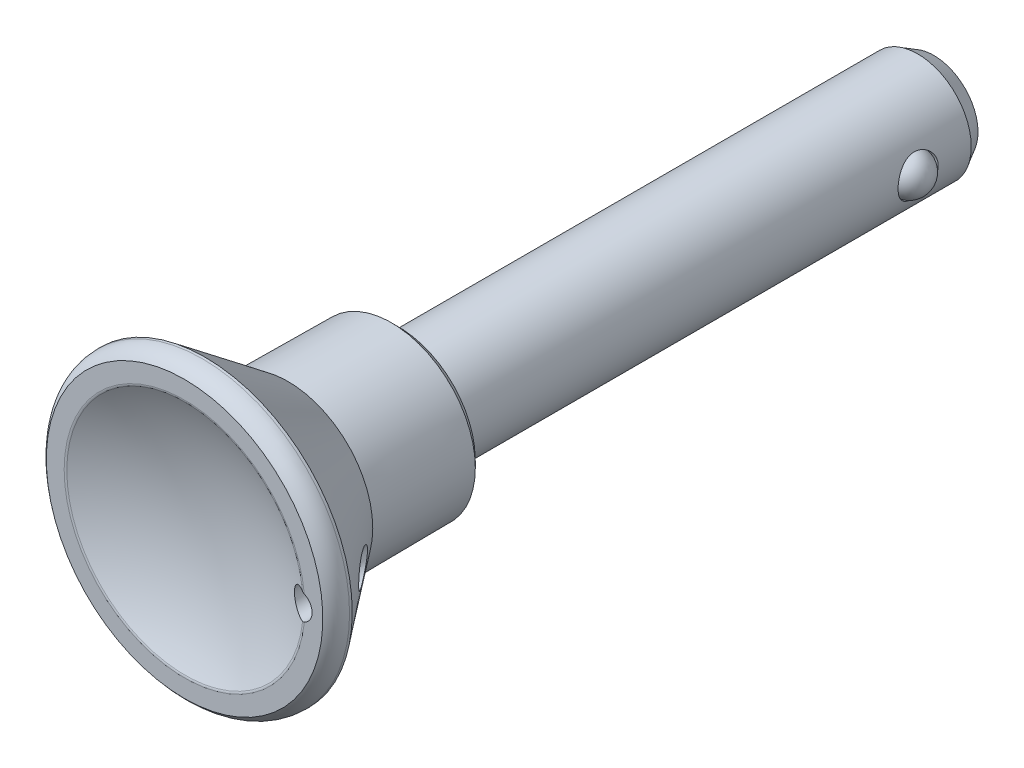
ISO-10303-21;
HEADER;
FILE_DESCRIPTION(('STEP AP214'),'2;1');
FILE_NAME('part.step','',(''),(''),'','','');
FILE_SCHEMA(('AUTOMOTIVE_DESIGN { 1 0 10303 214 1 1 1 1 }'));
ENDSEC;
DATA;
#1=APPLICATION_CONTEXT('core data for automotive mechanical design processes');
#2=APPLICATION_PROTOCOL_DEFINITION('international standard','automotive_design',2000,#1);
#3=PRODUCT_CONTEXT('',#1,'mechanical');
#4=PRODUCT('Part','Part','',(#3));
#5=PRODUCT_RELATED_PRODUCT_CATEGORY('part','',(#4));
#6=PRODUCT_DEFINITION_FORMATION('','',#4);
#7=PRODUCT_DEFINITION_CONTEXT('part definition',#1,'design');
#8=PRODUCT_DEFINITION('design','',#6,#7);
#9=PRODUCT_DEFINITION_SHAPE('','',#8);
#10=(LENGTH_UNIT() NAMED_UNIT(*) SI_UNIT(.MILLI.,.METRE.));
#11=(NAMED_UNIT(*) PLANE_ANGLE_UNIT() SI_UNIT($,.RADIAN.));
#12=(NAMED_UNIT(*) SI_UNIT($,.STERADIAN.) SOLID_ANGLE_UNIT());
#13=UNCERTAINTY_MEASURE_WITH_UNIT(LENGTH_MEASURE(1.E-05),#10,'distance_accuracy_value','');
#14=(GEOMETRIC_REPRESENTATION_CONTEXT(3) GLOBAL_UNCERTAINTY_ASSIGNED_CONTEXT((#13)) GLOBAL_UNIT_ASSIGNED_CONTEXT((#10,
#11,#12)) REPRESENTATION_CONTEXT('',''));
#15=CARTESIAN_POINT('',(0.,0.,0.));
#16=DIRECTION('',(0.,0.,1.));
#17=DIRECTION('',(1.,0.,0.));
#18=AXIS2_PLACEMENT_3D('',#15,#16,#17);
#19=CARTESIAN_POINT('',(0.,0.,23.5));
#20=DIRECTION('',(0.,0.,1.));
#21=DIRECTION('',(0.,-1.,0.));
#22=AXIS2_PLACEMENT_3D('',#19,#20,#21);
#23=TOROIDAL_SURFACE('',#22,13.499629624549,0.50000000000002);
#24=CARTESIAN_POINT('',(13.1832697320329,1.45020836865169,23.940350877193));
#25=CARTESIAN_POINT('',(13.1967898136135,1.44663630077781,23.9473693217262));
#26=CARTESIAN_POINT('',(13.2105528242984,1.44279517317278,23.9537540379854));
#27=CARTESIAN_POINT('',(13.2384329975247,1.43456873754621,23.9652617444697));
#28=CARTESIAN_POINT('',(13.2525500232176,1.43018363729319,23.9703852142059));
#29=CARTESIAN_POINT('',(13.294658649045,1.41639274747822,23.9836925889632));
#30=CARTESIAN_POINT('',(13.322980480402,1.40620303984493,23.9901034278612));
#31=CARTESIAN_POINT('',(13.3645007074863,1.38980064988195,23.9961744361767));
#32=CARTESIAN_POINT('',(13.377775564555,1.38433480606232,23.9976116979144));
#33=CARTESIAN_POINT('',(13.4043485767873,1.37294329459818,23.9995283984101));
#34=CARTESIAN_POINT('',(13.4176457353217,1.3670137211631,23.999998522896));
#35=CARTESIAN_POINT('',(13.430859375,1.3608881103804,24.));
#36=B_SPLINE_CURVE_WITH_KNOTS('',3,(#24,#25,#26,#27,#28,#29,#30,#31,#32,#33,#34,#35),
.UNSPECIFIED.,.F.,.F.,(4,2,2,2,2,4),(0.,0.046898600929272,0.0937793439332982,0.185591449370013,
0.228845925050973,0.272515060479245),.UNSPECIFIED.);
#37=CARTESIAN_POINT('',(13.1832697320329,1.45020836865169,23.940350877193));
#38=VERTEX_POINT('',#37);
#39=CARTESIAN_POINT('',(13.430859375,1.36088811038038,24.));
#40=VERTEX_POINT('',#39);
#41=EDGE_CURVE('E60',#38,#40,#36,.T.);
#42=ORIENTED_EDGE('',*,*,#41,.T.);
#43=CARTESIAN_POINT('',(0.,0.,24.));
#44=DIRECTION('',(0.,0.,1.));
#45=DIRECTION('',(0.,-1.,0.));
#46=AXIS2_PLACEMENT_3D('',#43,#44,#45);
#47=CIRCLE('',#46,13.499629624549);
#48=CARTESIAN_POINT('',(13.430859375,-1.36088811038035,24.));
#49=VERTEX_POINT('',#48);
#50=EDGE_CURVE('E39',#49,#40,#47,.F.);
#51=ORIENTED_EDGE('',*,*,#50,.F.);
#52=CARTESIAN_POINT('',(13.430859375,-1.36088811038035,24.));
#53=CARTESIAN_POINT('',(13.4166665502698,-1.36746807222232,23.9999984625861));
#54=CARTESIAN_POINT('',(13.4023759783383,-1.37382175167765,23.9994558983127));
#55=CARTESIAN_POINT('',(13.3736641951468,-1.38605678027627,23.9972288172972));
#56=CARTESIAN_POINT('',(13.3592428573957,-1.39193760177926,23.9955430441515));
#57=CARTESIAN_POINT('',(13.316571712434,-1.4085689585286,23.9887845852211));
#58=CARTESIAN_POINT('',(13.2882736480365,-1.41860415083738,23.9820148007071));
#59=CARTESIAN_POINT('',(13.2473798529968,-1.43179699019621,23.9685266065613));
#60=CARTESIAN_POINT('',(13.2344037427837,-1.43578270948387,23.9636790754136));
#61=CARTESIAN_POINT('',(13.2086362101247,-1.44332889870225,23.9528611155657));
#62=CARTESIAN_POINT('',(13.1958479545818,-1.44688469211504,23.9468798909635));
#63=CARTESIAN_POINT('',(13.1832697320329,-1.4502083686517,23.940350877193));
#64=B_SPLINE_CURVE_WITH_KNOTS('',3,(#52,#53,#54,#55,#56,#57,#58,#59,#60,#61,#62,#63),
.UNSPECIFIED.,.F.,.F.,(4,2,2,2,2,4),(0.,0.0469051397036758,0.0938619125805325,0.185680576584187,
0.228880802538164,0.272515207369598),.UNSPECIFIED.);
#65=CARTESIAN_POINT('',(13.1832697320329,-1.4502083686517,23.940350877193));
#66=VERTEX_POINT('',#65);
#67=EDGE_CURVE('E20',#49,#66,#64,.T.);
#68=ORIENTED_EDGE('',*,*,#67,.T.);
#69=CARTESIAN_POINT('',(0.,0.,23.940350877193));
#70=DIRECTION('',(0.,0.,1.));
#71=DIRECTION('',(0.,-1.,0.));
#72=AXIS2_PLACEMENT_3D('',#69,#70,#71);
#73=CIRCLE('',#72,13.2627940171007);
#74=EDGE_CURVE('E54',#38,#66,#73,.T.);
#75=ORIENTED_EDGE('',*,*,#74,.F.);
#76=EDGE_LOOP('',(#42,#51,#68,#75));
#77=FACE_BOUND('',#76,.T.);
#78=ADVANCED_FACE('F15',(#77),#23,.T.);
#79=CARTESIAN_POINT('',(0.,0.,48.6));
#80=DIRECTION('',(0.,-1.,0.));
#81=DIRECTION('',(0.,0.,1.));
#82=AXIS2_PLACEMENT_3D('',#79,#80,#81);
#83=SPHERICAL_SURFACE('',#82,28.);
#84=CARTESIAN_POINT('',(13.1832697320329,1.45020836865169,23.940350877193));
#85=CARTESIAN_POINT('',(13.0915993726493,1.4744532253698,23.8927620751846));
#86=CARTESIAN_POINT('',(12.9980560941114,1.489860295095,23.8443501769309));
#87=CARTESIAN_POINT('',(12.8097591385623,1.50293318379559,23.7471842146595));
#88=CARTESIAN_POINT('',(12.7150040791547,1.50057651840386,23.6984297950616));
#89=CARTESIAN_POINT('',(12.5270201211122,1.47798913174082,23.6019874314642));
#90=CARTESIAN_POINT('',(12.4337919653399,1.45774995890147,23.5543000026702));
#91=CARTESIAN_POINT('',(12.2517517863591,1.39948117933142,23.4614379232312));
#92=CARTESIAN_POINT('',(12.1629377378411,1.36145981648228,23.416262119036));
#93=CARTESIAN_POINT('',(11.9952411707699,1.26934990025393,23.3311736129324));
#94=CARTESIAN_POINT('',(11.9161458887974,1.21575714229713,23.2911465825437));
#95=CARTESIAN_POINT('',(11.7681643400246,1.09295087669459,23.2164149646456));
#96=CARTESIAN_POINT('',(11.6992729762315,1.02374521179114,23.1817077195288));
#97=CARTESIAN_POINT('',(11.5811025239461,0.878735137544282,23.1222729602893));
#98=CARTESIAN_POINT('',(11.5305709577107,0.804216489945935,23.0969048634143));
#99=CARTESIAN_POINT('',(11.4431131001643,0.645771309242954,23.0530473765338));
#100=CARTESIAN_POINT('',(11.4061726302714,0.561854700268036,23.0345508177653));
#101=CARTESIAN_POINT('',(11.3518094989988,0.398913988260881,23.0073479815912));
#102=CARTESIAN_POINT('',(11.332464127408,0.320688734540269,22.9976766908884));
#103=CARTESIAN_POINT('',(11.3065630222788,0.161638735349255,22.9847305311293));
#104=CARTESIAN_POINT('',(11.3000015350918,0.0808151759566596,22.9814527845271));
#105=CARTESIAN_POINT('',(11.2999985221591,-0.0778011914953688,22.9814513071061));
#106=CARTESIAN_POINT('',(11.3060768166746,-0.155594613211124,22.9844877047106));
#107=CARTESIAN_POINT('',(11.3300927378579,-0.308850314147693,22.9964912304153));
#108=CARTESIAN_POINT('',(11.3480306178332,-0.384312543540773,23.0054584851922));
#109=CARTESIAN_POINT('',(11.3948947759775,-0.530632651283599,23.0289063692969));
#110=CARTESIAN_POINT('',(11.4237977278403,-0.601499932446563,23.0433752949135));
#111=CARTESIAN_POINT('',(11.4913996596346,-0.737094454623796,23.0772561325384));
#112=CARTESIAN_POINT('',(11.5301003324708,-0.801820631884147,23.0966688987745));
#113=CARTESIAN_POINT('',(11.6176766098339,-0.9263609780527,23.1406602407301));
#114=CARTESIAN_POINT('',(11.6669073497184,-0.985860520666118,23.1654195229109));
#115=CARTESIAN_POINT('',(11.7728262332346,-1.09578522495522,23.2187793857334));
#116=CARTESIAN_POINT('',(11.8295165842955,-1.14620769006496,23.2473811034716));
#117=CARTESIAN_POINT('',(11.9547131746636,-1.24189507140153,23.3106654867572));
#118=CARTESIAN_POINT('',(12.0238340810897,-1.28614058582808,23.3456702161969));
#119=CARTESIAN_POINT('',(12.1672246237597,-1.36242212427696,23.4184517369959));
#120=CARTESIAN_POINT('',(12.2414976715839,-1.39444996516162,23.4562303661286));
#121=CARTESIAN_POINT('',(12.3592920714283,-1.4344825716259,23.5162885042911));
#122=CARTESIAN_POINT('',(12.4017101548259,-1.44682505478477,23.5379430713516));
#123=CARTESIAN_POINT('',(12.4872184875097,-1.46768648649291,23.5816530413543));
#124=CARTESIAN_POINT('',(12.5303081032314,-1.47620883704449,23.603708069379));
#125=CARTESIAN_POINT('',(12.6602504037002,-1.49604024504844,23.6703078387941));
#126=CARTESIAN_POINT('',(12.7478240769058,-1.50162964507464,23.7153114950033));
#127=CARTESIAN_POINT('',(12.8938293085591,-1.49821627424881,23.7905484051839));
#128=CARTESIAN_POINT('',(12.9524047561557,-1.49339577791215,23.8207882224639));
#129=CARTESIAN_POINT('',(13.0686394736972,-1.47691090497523,23.8809033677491));
#130=CARTESIAN_POINT('',(13.1263001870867,-1.46525870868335,23.9107792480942));
#131=CARTESIAN_POINT('',(13.1832697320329,-1.4502083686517,23.9403508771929));
#132=B_SPLINE_CURVE_WITH_KNOTS('',3,(#84,#85,#86,#87,#88,#89,#90,#91,#92,#93,#94,#95,#96,#97,
#98,#99,#100,#101,#102,#103,#104,#105,#106,#107,#108,#109,#110,#111,#112,#113,#114,#115,#116,
#117,#118,#119,#120,#121,#122,#123,#124,#125,#126,#127,#128,#129,#130,#131),.UNSPECIFIED.,.F.,
.F.,(4,2,2,2,2,2,2,2,2,2,2,2,2,2,2,2,2,2,2,2,2,2,2,4),(0.,0.317865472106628,0.636133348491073,
0.954551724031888,1.27282262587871,1.58190076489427,1.89082399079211,2.16986616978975,
2.44861641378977,2.69085568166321,2.93298589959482,3.16608592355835,3.39919092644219,
3.63180279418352,3.8644548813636,4.10674626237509,4.34910950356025,4.61569988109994,
4.88246850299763,5.02992533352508,5.17725058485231,5.4717357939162,5.66970066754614,
5.86731365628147),.UNSPECIFIED.);
#133=EDGE_CURVE('E50',#38,#66,#132,.T.);
#134=ORIENTED_EDGE('',*,*,#133,.F.);
#135=ORIENTED_EDGE('',*,*,#74,.T.);
#136=EDGE_LOOP('',(#134,#135));
#137=FACE_BOUND('',#136,.T.);
#138=ADVANCED_FACE('F52',(#137),#83,.F.);
#139=CARTESIAN_POINT('',(-15.81,-15.5,24.));
#140=CARTESIAN_POINT('',(-15.5,-15.5,24.));
#141=CARTESIAN_POINT('',(15.5,-15.5,24.));
#142=B_SPLINE_CURVE_WITH_KNOTS('',1,(#139,#140,#141),.UNSPECIFIED.,.F.,.F.,(2,1,2),(-0.01,0.,
1.),.UNSPECIFIED.);
#143=DIRECTION('',(0.,1.,0.));
#144=VECTOR('',#143,1.);
#145=SURFACE_OF_LINEAR_EXTRUSION('',#142,#144);
#146=CARTESIAN_POINT('',(12.8,0.,24.));
#147=DIRECTION('',(0.,0.,1.));
#148=DIRECTION('',(0.,-1.,0.));
#149=AXIS2_PLACEMENT_3D('',#146,#147,#148);
#150=CIRCLE('',#149,1.5);
#151=EDGE_CURVE('E57',#49,#40,#150,.T.);
#152=ORIENTED_EDGE('',*,*,#151,.F.);
#153=ORIENTED_EDGE('',*,*,#50,.T.);
#154=EDGE_LOOP('',(#152,#153));
#155=FACE_BOUND('',#154,.T.);
#156=CARTESIAN_POINT('',(0.,0.,24.));
#157=DIRECTION('',(0.,0.,1.));
#158=DIRECTION('',(0.,-1.,0.));
#159=AXIS2_PLACEMENT_3D('',#156,#157,#158);
#160=CIRCLE('',#159,15.5);
#161=CARTESIAN_POINT('',(0.,-15.5,24.));
#162=VERTEX_POINT('',#161);
#163=EDGE_CURVE('E58',#162,#162,#160,.F.);
#164=ORIENTED_EDGE('',*,*,#163,.F.);
#165=EDGE_LOOP('',(#164));
#166=FACE_BOUND('',#165,.T.);
#167=ADVANCED_FACE('F192',(#155,#166),#145,.T.);
#168=CARTESIAN_POINT('',(0.,0.,22.));
#169=DIRECTION('',(0.,0.,1.));
#170=DIRECTION('',(0.,-1.,0.));
#171=AXIS2_PLACEMENT_3D('',#168,#169,#170);
#172=TOROIDAL_SURFACE('',#171,14.,2.5);
#173=ORIENTED_EDGE('',*,*,#163,.T.);
#174=EDGE_LOOP('',(#173));
#175=FACE_BOUND('',#174,.T.);
#176=CARTESIAN_POINT('',(0.,0.,22.));
#177=DIRECTION('',(0.,0.,1.));
#178=DIRECTION('',(1.,0.,0.));
#179=AXIS2_PLACEMENT_3D('',#176,#177,#178);
#180=CIRCLE('',#179,16.5);
#181=CARTESIAN_POINT('',(16.5,0.,22.));
#182=VERTEX_POINT('',#181);
#183=EDGE_CURVE('E101',#182,#182,#180,.F.);
#184=ORIENTED_EDGE('',*,*,#183,.F.);
#185=EDGE_LOOP('',(#184));
#186=FACE_BOUND('',#185,.T.);
#187=ADVANCED_FACE('F79',(#175,#186),#172,.T.);
#188=CARTESIAN_POINT('',(12.8,0.,14.7910576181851));
#189=DIRECTION('',(0.,0.,1.));
#190=DIRECTION('',(0.,-1.,0.));
#191=AXIS2_PLACEMENT_3D('',#188,#189,#190);
#192=CYLINDRICAL_SURFACE('',#191,1.5);
#193=CARTESIAN_POINT('',(12.62421875,-1.48966471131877,16.6671130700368));
#194=CARTESIAN_POINT('',(12.6920032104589,-1.49766166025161,16.7577945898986));
#195=CARTESIAN_POINT('',(12.7603283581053,-1.50104579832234,16.8484671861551));
#196=CARTESIAN_POINT('',(12.897645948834,-1.49839397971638,17.0292601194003));
#197=CARTESIAN_POINT('',(12.9666387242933,-1.49235306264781,17.1193801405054));
#198=CARTESIAN_POINT('',(13.1046564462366,-1.47039580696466,17.2982798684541));
#199=CARTESIAN_POINT('',(13.1736813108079,-1.45448817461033,17.3870606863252));
#200=CARTESIAN_POINT('',(13.3110827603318,-1.41207641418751,17.5624849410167));
#201=CARTESIAN_POINT('',(13.3794598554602,-1.38558148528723,17.6491301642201));
#202=CARTESIAN_POINT('',(13.5187485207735,-1.31898430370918,17.8243946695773));
#203=CARTESIAN_POINT('',(13.5895656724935,-1.27816038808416,17.9128199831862));
#204=CARTESIAN_POINT('',(13.7277317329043,-1.18169522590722,18.084148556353));
#205=CARTESIAN_POINT('',(13.7950853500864,-1.12607476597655,18.1670593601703));
#206=CARTESIAN_POINT('',(13.9084086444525,-1.01303116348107,18.3057043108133));
#207=CARTESIAN_POINT('',(13.9556726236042,-0.959133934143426,18.3632332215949));
#208=CARTESIAN_POINT('',(14.0446143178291,-0.840483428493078,18.471045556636));
#209=CARTESIAN_POINT('',(14.0863013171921,-0.77574860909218,18.5213410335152));
#210=CARTESIAN_POINT('',(14.1507925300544,-0.65471783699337,18.5988956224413));
#211=CARTESIAN_POINT('',(14.1756178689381,-0.601120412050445,18.6286642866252));
#212=CARTESIAN_POINT('',(14.2195452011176,-0.488403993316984,18.6812412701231));
#213=CARTESIAN_POINT('',(14.238652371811,-0.429290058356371,18.7040558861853));
#214=CARTESIAN_POINT('',(14.2689681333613,-0.309460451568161,18.7402118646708));
#215=CARTESIAN_POINT('',(14.2805052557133,-0.248950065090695,18.7539474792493));
#216=CARTESIAN_POINT('',(14.2960184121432,-0.12562551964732,18.77240966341));
#217=CARTESIAN_POINT('',(14.3000000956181,-0.0628131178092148,18.7771429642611));
#218=CARTESIAN_POINT('',(14.2999999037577,0.0632231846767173,18.7771427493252));
#219=CARTESIAN_POINT('',(14.2959658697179,0.126447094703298,18.7723472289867));
#220=CARTESIAN_POINT('',(14.2802519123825,0.250551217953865,18.7536458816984));
#221=CARTESIAN_POINT('',(14.2685662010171,0.311429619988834,18.7397331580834));
#222=CARTESIAN_POINT('',(14.2387365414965,0.42856422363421,18.7041556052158));
#223=CARTESIAN_POINT('',(14.2206451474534,0.484853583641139,18.6825538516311));
#224=CARTESIAN_POINT('',(14.1792492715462,0.592453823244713,18.633014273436));
#225=CARTESIAN_POINT('',(14.1559422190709,0.643762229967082,18.6050733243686));
#226=CARTESIAN_POINT('',(14.0931329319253,0.764461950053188,18.5295741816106));
#227=CARTESIAN_POINT('',(14.0512237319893,0.830727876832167,18.4790335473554));
#228=CARTESIAN_POINT('',(13.9615408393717,0.952125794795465,18.370367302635));
#229=CARTESIAN_POINT('',(13.9137529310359,1.00722990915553,18.3122232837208));
#230=CARTESIAN_POINT('',(13.7883270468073,1.13348006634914,18.158818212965));
#231=CARTESIAN_POINT('',(13.708179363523,1.1978805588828,18.0600849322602));
#232=CARTESIAN_POINT('',(13.5435609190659,1.3064664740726,17.8554996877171));
#233=CARTESIAN_POINT('',(13.4590828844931,1.35061655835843,17.7496356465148));
#234=CARTESIAN_POINT('',(13.3107013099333,1.41202717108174,17.5619635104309));
#235=CARTESIAN_POINT('',(13.2471965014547,1.43330058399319,17.4811068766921));
#236=CARTESIAN_POINT('',(13.1198264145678,1.46698834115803,17.3177942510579));
#237=CARTESIAN_POINT('',(13.0559609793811,1.47939847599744,17.2353375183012));
#238=CARTESIAN_POINT('',(12.9282718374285,1.49589397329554,17.0692879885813));
#239=CARTESIAN_POINT('',(12.8644485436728,1.49996064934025,16.9856930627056));
#240=CARTESIAN_POINT('',(12.7374091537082,1.5000387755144,16.8180712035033));
#241=CARTESIAN_POINT('',(12.6741929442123,1.49605175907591,16.7340443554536));
#242=CARTESIAN_POINT('',(12.5469978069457,1.47993658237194,16.5637117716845));
#243=CARTESIAN_POINT('',(12.4830456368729,1.46758777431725,16.4774068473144));
#244=CARTESIAN_POINT('',(12.3565302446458,1.43443826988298,16.3053467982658));
#245=CARTESIAN_POINT('',(12.2939675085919,1.41363466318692,16.2195918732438));
#246=CARTESIAN_POINT('',(12.1709555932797,1.36334219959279,16.0496685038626));
#247=CARTESIAN_POINT('',(12.1104987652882,1.33388949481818,15.9654949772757));
#248=CARTESIAN_POINT('',(11.9920388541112,1.26565016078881,15.7992974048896));
#249=CARTESIAN_POINT('',(11.9340336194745,1.22687192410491,15.7172714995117));
#250=CARTESIAN_POINT('',(11.8266654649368,1.14315320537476,15.5643050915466));
#251=CARTESIAN_POINT('',(11.7770073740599,1.09916121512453,15.4930561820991));
#252=CARTESIAN_POINT('',(11.6811267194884,1.0014126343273,15.3545942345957));
#253=CARTESIAN_POINT('',(11.6349116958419,0.947635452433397,15.2873901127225));
#254=CARTESIAN_POINT('',(11.5691423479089,0.858125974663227,15.1911821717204));
#255=CARTESIAN_POINT('',(11.5476572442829,0.826531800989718,15.1596504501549));
#256=CARTESIAN_POINT('',(11.5063433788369,0.760253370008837,15.0988444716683));
#257=CARTESIAN_POINT('',(11.4865152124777,0.72556801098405,15.0695710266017));
#258=CARTESIAN_POINT('',(11.4302732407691,0.616814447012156,14.9863165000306));
#259=CARTESIAN_POINT('',(11.3967954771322,0.537651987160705,14.9364517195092));
#260=CARTESIAN_POINT('',(11.3555291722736,0.407099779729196,14.8747804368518));
#261=CARTESIAN_POINT('',(11.3430899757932,0.360365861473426,14.856144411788));
#262=CARTESIAN_POINT('',(11.3225831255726,0.263914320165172,14.8253840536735));
#263=CARTESIAN_POINT('',(11.3145046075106,0.214204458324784,14.8132435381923));
#264=CARTESIAN_POINT('',(11.3059949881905,0.136701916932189,14.8004485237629));
#265=CARTESIAN_POINT('',(11.3037543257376,0.109528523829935,14.7970776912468));
#266=CARTESIAN_POINT('',(11.300755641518,0.0549082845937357,14.7925658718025));
#267=CARTESIAN_POINT('',(11.2999979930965,0.0274613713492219,14.791425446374));
#268=CARTESIAN_POINT('',(11.3000036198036,-0.0495314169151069,14.7914342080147));
#269=CARTESIAN_POINT('',(11.3024785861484,-0.0991098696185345,14.7951600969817));
#270=CARTESIAN_POINT('',(11.3121472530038,-0.196763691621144,14.8096998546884));
#271=CARTESIAN_POINT('',(11.3193489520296,-0.244836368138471,14.8205257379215));
#272=CARTESIAN_POINT('',(11.3399096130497,-0.348584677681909,14.8513795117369));
#273=CARTESIAN_POINT('',(11.3542736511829,-0.403610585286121,14.872906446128));
#274=CARTESIAN_POINT('',(11.387815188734,-0.508718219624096,14.9230284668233));
#275=CARTESIAN_POINT('',(11.4070004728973,-0.558791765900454,14.9516349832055));
#276=CARTESIAN_POINT('',(11.4595328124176,-0.67767183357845,15.0296959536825));
#277=CARTESIAN_POINT('',(11.4951602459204,-0.743300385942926,15.0824162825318));
#278=CARTESIAN_POINT('',(11.5718624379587,-0.864190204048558,15.1952386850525));
#279=CARTESIAN_POINT('',(11.6129512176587,-0.919423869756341,15.2553597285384));
#280=CARTESIAN_POINT('',(11.6921657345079,-1.01283475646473,15.3705343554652));
#281=CARTESIAN_POINT('',(11.7297508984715,-1.05232856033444,15.4249113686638));
#282=CARTESIAN_POINT('',(11.8070065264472,-1.12552131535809,15.5360737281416));
#283=CARTESIAN_POINT('',(11.8466784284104,-1.15921620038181,15.5928607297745));
#284=CARTESIAN_POINT('',(11.9276586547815,-1.22132048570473,15.7081342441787));
#285=CARTESIAN_POINT('',(11.9689673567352,-1.24972865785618,15.7666211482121));
#286=CARTESIAN_POINT('',(12.0529136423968,-1.30165144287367,15.884812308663));
#287=CARTESIAN_POINT('',(12.0955516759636,-1.32516437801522,15.9445169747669));
#288=CARTESIAN_POINT('',(12.2167649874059,-1.38470455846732,16.1132939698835));
#289=CARTESIAN_POINT('',(12.2965837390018,-1.41552588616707,16.2233378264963));
#290=CARTESIAN_POINT('',(12.458735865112,-1.46310486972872,16.4446295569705));
#291=CARTESIAN_POINT('',(12.5410705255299,-1.47985520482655,16.5558780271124));
#292=CARTESIAN_POINT('',(12.62421875,-1.48966471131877,16.6671130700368));
#293=B_SPLINE_CURVE_WITH_KNOTS('',3,(#193,#194,#195,#196,#197,#198,#199,#200,#201,#202,#203,
#204,#205,#206,#207,#208,#209,#210,#211,#212,#213,#214,#215,#216,#217,#218,#219,#220,#221,#222,
#223,#224,#225,#226,#227,#228,#229,#230,#231,#232,#233,#234,#235,#236,#237,#238,#239,#240,#241,
#242,#243,#244,#245,#246,#247,#248,#249,#250,#251,#252,#253,#254,#255,#256,#257,#258,#259,#260,
#261,#262,#263,#264,#265,#266,#267,#268,#269,#270,#271,#272,#273,#274,#275,#276,#277,#278,#279,
#280,#281,#282,#283,#284,#285,#286,#287,#288,#289,#290,#291,#292),.UNSPECIFIED.,.T.,.F.,(4,2,2,
2,2,2,2,2,2,2,2,2,2,2,2,2,2,2,2,2,2,2,2,2,2,2,2,2,2,2,2,2,2,2,2,2,2,2,2,2,2,2,2,2,2,2,2,2,2,4),
(0.,0.3403810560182,0.680941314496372,1.02120149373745,1.36116666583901,1.72154948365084,
2.08142867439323,2.35634247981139,2.63079277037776,2.82853330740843,3.02609425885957,
3.21438583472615,3.40253656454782,3.59191561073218,3.78143807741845,3.96944036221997,
4.15753551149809,4.43581804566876,4.71478725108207,5.14007838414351,5.56610888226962,
5.88069336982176,6.19542716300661,6.51086508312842,6.82624294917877,7.15028500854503,
7.47443870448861,7.79725631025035,8.11978447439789,8.41136093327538,8.70355821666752,
8.8520054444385,9.00050579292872,9.29551066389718,9.45047012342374,9.60504170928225,
9.6873437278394,9.76966646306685,9.91815000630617,10.0668854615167,10.2482950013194,
10.4299993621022,10.7027068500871,10.9761285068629,11.2068168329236,11.4376662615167,
11.6685692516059,11.8995512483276,12.3168647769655,12.7343952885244),.UNSPECIFIED.);
#294=CARTESIAN_POINT('',(12.62421875,-1.48966471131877,16.6671130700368));
#295=VERTEX_POINT('',#294);
#296=EDGE_CURVE('E93',#295,#295,#293,.T.);
#297=ORIENTED_EDGE('',*,*,#296,.F.);
#298=EDGE_LOOP('',(#297));
#299=FACE_BOUND('',#298,.T.);
#300=ORIENTED_EDGE('',*,*,#67,.F.);
#301=ORIENTED_EDGE('',*,*,#151,.T.);
#302=ORIENTED_EDGE('',*,*,#41,.F.);
#303=ORIENTED_EDGE('',*,*,#133,.T.);
#304=EDGE_LOOP('',(#300,#301,#302,#303));
#305=FACE_BOUND('',#304,.T.);
#306=ADVANCED_FACE('F61',(#299,#305),#192,.F.);
#307=CARTESIAN_POINT('',(0.,0.,22.));
#308=DIRECTION('',(0.,0.,1.));
#309=DIRECTION('',(0.,-1.,0.));
#310=AXIS2_PLACEMENT_3D('',#307,#308,#309);
#311=CYLINDRICAL_SURFACE('',#310,16.5);
#312=ORIENTED_EDGE('',*,*,#183,.T.);
#313=EDGE_LOOP('',(#312));
#314=FACE_BOUND('',#313,.T.);
#315=CARTESIAN_POINT('',(0.,0.,21.7));
#316=DIRECTION('',(0.,0.,-1.));
#317=DIRECTION('',(1.,0.,0.));
#318=AXIS2_PLACEMENT_3D('',#315,#316,#317);
#319=CIRCLE('',#318,16.5);
#320=CARTESIAN_POINT('',(16.5,0.,21.7));
#321=VERTEX_POINT('',#320);
#322=EDGE_CURVE('E100',#321,#321,#319,.T.);
#323=ORIENTED_EDGE('',*,*,#322,.F.);
#324=EDGE_LOOP('',(#323));
#325=FACE_BOUND('',#324,.T.);
#326=ADVANCED_FACE('F78',(#314,#325),#311,.T.);
#327=CARTESIAN_POINT('',(0.,0.,12.4));
#328=DIRECTION('',(0.,0.,1.));
#329=DIRECTION('',(0.,-1.,0.));
#330=AXIS2_PLACEMENT_3D('',#327,#328,#329);
#331=CONICAL_SURFACE('',#330,9.5,0.645219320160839);
#332=ORIENTED_EDGE('',*,*,#296,.T.);
#333=EDGE_LOOP('',(#332));
#334=FACE_BOUND('',#333,.T.);
#335=ORIENTED_EDGE('',*,*,#322,.T.);
#336=EDGE_LOOP('',(#335));
#337=FACE_BOUND('',#336,.T.);
#338=CARTESIAN_POINT('',(0.,0.,12.4));
#339=DIRECTION('',(0.,0.,-1.));
#340=DIRECTION('',(1.,0.,0.));
#341=AXIS2_PLACEMENT_3D('',#338,#339,#340);
#342=CIRCLE('',#341,9.5);
#343=CARTESIAN_POINT('',(9.5,0.,12.4));
#344=VERTEX_POINT('',#343);
#345=EDGE_CURVE('E173',#344,#344,#342,.T.);
#346=ORIENTED_EDGE('',*,*,#345,.F.);
#347=EDGE_LOOP('',(#346));
#348=FACE_BOUND('',#347,.T.);
#349=ADVANCED_FACE('F102',(#334,#337,#348),#331,.T.);
#350=CARTESIAN_POINT('',(0.,0.,0.799969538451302));
#351=DIRECTION('',(0.,0.,1.));
#352=DIRECTION('',(0.,-1.,0.));
#353=AXIS2_PLACEMENT_3D('',#350,#351,#352);
#354=CONICAL_SURFACE('',#353,9.39876806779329,0.00872664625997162);
#355=ORIENTED_EDGE('',*,*,#345,.T.);
#356=EDGE_LOOP('',(#355));
#357=FACE_BOUND('',#356,.T.);
#358=CARTESIAN_POINT('',(0.,0.,0.799969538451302));
#359=DIRECTION('',(0.,0.,-1.));
#360=DIRECTION('',(1.,0.,0.));
#361=AXIS2_PLACEMENT_3D('',#358,#359,#360);
#362=CIRCLE('',#361,9.39876806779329);
#363=CARTESIAN_POINT('',(9.39876806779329,0.,0.799969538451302));
#364=VERTEX_POINT('',#363);
#365=EDGE_CURVE('E169',#364,#364,#362,.T.);
#366=ORIENTED_EDGE('',*,*,#365,.F.);
#367=EDGE_LOOP('',(#366));
#368=FACE_BOUND('',#367,.T.);
#369=ADVANCED_FACE('F106',(#357,#368),#354,.T.);
#370=CARTESIAN_POINT('',(0.,0.,0.));
#371=DIRECTION('',(0.,0.,1.));
#372=DIRECTION('',(0.,-1.,0.));
#373=AXIS2_PLACEMENT_3D('',#370,#371,#372);
#374=CONICAL_SURFACE('',#373,8.59178683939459,0.789761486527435);
#375=ORIENTED_EDGE('',*,*,#365,.T.);
#376=EDGE_LOOP('',(#375));
#377=FACE_BOUND('',#376,.T.);
#378=CARTESIAN_POINT('',(0.,0.,0.));
#379=DIRECTION('',(0.,0.,1.));
#380=DIRECTION('',(0.,-1.,0.));
#381=AXIS2_PLACEMENT_3D('',#378,#379,#380);
#382=CIRCLE('',#381,8.59178683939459);
#383=CARTESIAN_POINT('',(0.,-8.59178683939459,0.));
#384=VERTEX_POINT('',#383);
#385=EDGE_CURVE('E32',#384,#384,#382,.F.);
#386=ORIENTED_EDGE('',*,*,#385,.F.);
#387=EDGE_LOOP('',(#386));
#388=FACE_BOUND('',#387,.T.);
#389=ADVANCED_FACE('F110',(#377,#388),#374,.T.);
#390=CARTESIAN_POINT('',(8.5917868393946,-8.69489038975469,0.));
#391=DIRECTION('',(0.,0.,-1.));
#392=DIRECTION('',(-1.,0.,0.));
#393=AXIS2_PLACEMENT_3D('',#390,#391,#392);
#394=PLANE('',#393);
#395=CARTESIAN_POINT('',(0.,0.,0.));
#396=DIRECTION('',(0.,0.,1.));
#397=DIRECTION('',(0.,-1.,0.));
#398=AXIS2_PLACEMENT_3D('',#395,#396,#397);
#399=CIRCLE('',#398,6.);
#400=CARTESIAN_POINT('',(0.,-6.,0.));
#401=VERTEX_POINT('',#400);
#402=EDGE_CURVE('E9',#401,#401,#399,.F.);
#403=ORIENTED_EDGE('',*,*,#402,.F.);
#404=EDGE_LOOP('',(#403));
#405=FACE_BOUND('',#404,.T.);
#406=ORIENTED_EDGE('',*,*,#385,.T.);
#407=EDGE_LOOP('',(#406));
#408=FACE_BOUND('',#407,.T.);
#409=ADVANCED_FACE('F114',(#405,#408),#394,.T.);
#410=CARTESIAN_POINT('',(0.,0.,0.));
#411=DIRECTION('',(0.,0.,1.));
#412=DIRECTION('',(0.,-1.,0.));
#413=AXIS2_PLACEMENT_3D('',#410,#411,#412);
#414=CYLINDRICAL_SURFACE('',#413,6.);
#415=ORIENTED_EDGE('',*,*,#402,.T.);
#416=EDGE_LOOP('',(#415));
#417=FACE_BOUND('',#416,.T.);
#418=CARTESIAN_POINT('',(6.,0.,-50.));
#419=CARTESIAN_POINT('',(5.99999462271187,0.121667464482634,-50.000007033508));
#420=CARTESIAN_POINT('',(5.9962597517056,0.243448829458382,-50.0099159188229));
#421=CARTESIAN_POINT('',(5.98170081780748,0.483504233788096,-50.0491900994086));
#422=CARTESIAN_POINT('',(5.97086593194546,0.601772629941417,-50.0785850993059));
#423=CARTESIAN_POINT('',(5.9432796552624,0.831103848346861,-50.1556365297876));
#424=CARTESIAN_POINT('',(5.92654369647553,0.942184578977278,-50.203245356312));
#425=CARTESIAN_POINT('',(5.88882492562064,1.1547332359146,-50.3151801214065));
#426=CARTESIAN_POINT('',(5.86784233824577,1.25620167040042,-50.3795051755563));
#427=CARTESIAN_POINT('',(5.82279419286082,1.45101685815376,-50.5259171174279));
#428=CARTESIAN_POINT('',(5.79864114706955,1.54390166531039,-50.6085915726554));
#429=CARTESIAN_POINT('',(5.75040444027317,1.71486282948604,-50.7881111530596));
#430=CARTESIAN_POINT('',(5.72632080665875,1.79293396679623,-50.8849612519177));
#431=CARTESIAN_POINT('',(5.67993703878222,1.93497305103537,-51.0945762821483));
#432=CARTESIAN_POINT('',(5.65773970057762,1.99829097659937,-51.207806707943));
#433=CARTESIAN_POINT('',(5.61899788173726,2.10477976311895,-51.4442726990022));
#434=CARTESIAN_POINT('',(5.60245113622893,2.1479586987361,-51.5675042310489));
#435=CARTESIAN_POINT('',(5.5778161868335,2.21112647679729,-51.8151751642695));
#436=CARTESIAN_POINT('',(5.56940885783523,2.23199391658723,-51.9393576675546));
#437=CARTESIAN_POINT('',(5.56107092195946,2.25269334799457,-52.1897243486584));
#438=CARTESIAN_POINT('',(5.56113680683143,2.25253404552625,-52.315907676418));
#439=CARTESIAN_POINT('',(5.56946266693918,2.23185646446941,-52.5586540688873));
#440=CARTESIAN_POINT('',(5.57723200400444,2.21255720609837,-52.6753409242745));
#441=CARTESIAN_POINT('',(5.59927401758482,2.15616264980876,-52.9036803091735));
#442=CARTESIAN_POINT('',(5.61354769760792,2.11906460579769,-53.0153320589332));
#443=CARTESIAN_POINT('',(5.64728592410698,2.02745519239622,-53.2329181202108));
#444=CARTESIAN_POINT('',(5.6668436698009,1.97262730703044,-53.3387040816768));
#445=CARTESIAN_POINT('',(5.70891418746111,1.84733776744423,-53.5399230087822));
#446=CARTESIAN_POINT('',(5.73142784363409,1.77687143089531,-53.6353528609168));
#447=CARTESIAN_POINT('',(5.7787168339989,1.61673979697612,-53.8198908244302));
#448=CARTESIAN_POINT('',(5.80354258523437,1.52610382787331,-53.9081456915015));
#449=CARTESIAN_POINT('',(5.85136882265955,1.33099961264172,-54.0684848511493));
#450=CARTESIAN_POINT('',(5.87436846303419,1.22652501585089,-54.1405616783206));
#451=CARTESIAN_POINT('',(5.9164128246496,1.00450158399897,-54.2674460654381));
#452=CARTESIAN_POINT('',(5.93538783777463,0.886769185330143,-54.3219566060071));
#453=CARTESIAN_POINT('',(5.96670045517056,0.643032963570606,-54.4100294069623));
#454=CARTESIAN_POINT('',(5.97905147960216,0.517046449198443,-54.4436340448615));
#455=CARTESIAN_POINT('',(5.99154588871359,0.324874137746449,-54.4773780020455));
#456=CARTESIAN_POINT('',(5.99470542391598,0.260242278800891,-54.4858488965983));
#457=CARTESIAN_POINT('',(5.99893391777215,0.130417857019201,-54.4971617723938));
#458=CARTESIAN_POINT('',(6.00000288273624,0.0652252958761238,-54.5000037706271));
#459=CARTESIAN_POINT('',(5.99999462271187,-0.121667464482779,-54.499992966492));
#460=CARTESIAN_POINT('',(5.9962597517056,-0.243448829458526,-54.4900840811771));
#461=CARTESIAN_POINT('',(5.98170081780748,-0.48350423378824,-54.4508099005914));
#462=CARTESIAN_POINT('',(5.97086593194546,-0.601772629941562,-54.4214149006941));
#463=CARTESIAN_POINT('',(5.9432796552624,-0.831103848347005,-54.3443634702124));
#464=CARTESIAN_POINT('',(5.92654369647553,-0.942184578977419,-54.296754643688));
#465=CARTESIAN_POINT('',(5.88882492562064,-1.15473323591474,-54.1848198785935));
#466=CARTESIAN_POINT('',(5.86784233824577,-1.25620167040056,-54.1204948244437));
#467=CARTESIAN_POINT('',(5.82279419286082,-1.4510168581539,-53.9740828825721));
#468=CARTESIAN_POINT('',(5.79864114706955,-1.54390166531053,-53.8914084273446));
#469=CARTESIAN_POINT('',(5.75040444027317,-1.71486282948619,-53.7118888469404));
#470=CARTESIAN_POINT('',(5.72632080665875,-1.79293396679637,-53.6150387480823));
#471=CARTESIAN_POINT('',(5.67993703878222,-1.93497305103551,-53.4054237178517));
#472=CARTESIAN_POINT('',(5.65773970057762,-1.99829097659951,-53.292193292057));
#473=CARTESIAN_POINT('',(5.61899788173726,-2.10477976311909,-53.0557273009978));
#474=CARTESIAN_POINT('',(5.60245113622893,-2.14795869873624,-52.9324957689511));
#475=CARTESIAN_POINT('',(5.5778161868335,-2.21112647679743,-52.6848248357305));
#476=CARTESIAN_POINT('',(5.56940885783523,-2.23199391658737,-52.5606423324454));
#477=CARTESIAN_POINT('',(5.56107092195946,-2.25269334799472,-52.3102756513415));
#478=CARTESIAN_POINT('',(5.56113680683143,-2.25253404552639,-52.184092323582));
#479=CARTESIAN_POINT('',(5.56946266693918,-2.23185646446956,-51.9413459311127));
#480=CARTESIAN_POINT('',(5.57723200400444,-2.21255720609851,-51.8246590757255));
#481=CARTESIAN_POINT('',(5.59927401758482,-2.1561626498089,-51.5963196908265));
#482=CARTESIAN_POINT('',(5.61354769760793,-2.11906460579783,-51.4846679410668));
#483=CARTESIAN_POINT('',(5.64728592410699,-2.02745519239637,-51.2670818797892));
#484=CARTESIAN_POINT('',(5.6668436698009,-1.97262730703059,-51.1612959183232));
#485=CARTESIAN_POINT('',(5.70891418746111,-1.84733776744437,-50.9600769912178));
#486=CARTESIAN_POINT('',(5.73142784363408,-1.77687143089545,-50.8646471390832));
#487=CARTESIAN_POINT('',(5.7787168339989,-1.61673979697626,-50.6801091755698));
#488=CARTESIAN_POINT('',(5.80354258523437,-1.52610382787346,-50.5918543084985));
#489=CARTESIAN_POINT('',(5.85136882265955,-1.33099961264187,-50.4315151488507));
#490=CARTESIAN_POINT('',(5.87436846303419,-1.22652501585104,-50.3594383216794));
#491=CARTESIAN_POINT('',(5.9164128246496,-1.00450158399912,-50.232553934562));
#492=CARTESIAN_POINT('',(5.93538783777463,-0.886769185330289,-50.1780433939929));
#493=CARTESIAN_POINT('',(5.96670045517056,-0.64303296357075,-50.0899705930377));
#494=CARTESIAN_POINT('',(5.97905147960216,-0.517046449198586,-50.0563659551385));
#495=CARTESIAN_POINT('',(5.99154588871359,-0.324874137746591,-50.0226219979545));
#496=CARTESIAN_POINT('',(5.99470542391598,-0.260242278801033,-50.0141511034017));
#497=CARTESIAN_POINT('',(5.99893391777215,-0.130417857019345,-50.0028382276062));
#498=CARTESIAN_POINT('',(6.00000288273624,-0.0652252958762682,-49.9999962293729));
#499=CARTESIAN_POINT('',(6.,0.,-50.));
#500=B_SPLINE_CURVE_WITH_KNOTS('',3,(#418,#419,#420,#421,#422,#423,#424,#425,#426,#427,#428,
#429,#430,#431,#432,#433,#434,#435,#436,#437,#438,#439,#440,#441,#442,#443,#444,#445,#446,#447,
#448,#449,#450,#451,#452,#453,#454,#455,#456,#457,#458,#459,#460,#461,#462,#463,#464,#465,#466,
#467,#468,#469,#470,#471,#472,#473,#474,#475,#476,#477,#478,#479,#480,#481,#482,#483,#484,#485,
#486,#487,#488,#489,#490,#491,#492,#493,#494,#495,#496,#497,#498,#499),.UNSPECIFIED.,.T.,.F.,(4,
2,2,2,2,2,2,2,2,2,2,2,2,2,2,2,2,2,2,2,2,2,2,2,2,2,2,2,2,2,2,2,2,2,2,2,2,2,2,2,4),(0.,
0.364749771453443,0.730056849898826,1.09441560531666,1.45875508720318,1.83709555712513,
2.21556909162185,2.60845040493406,3.0011740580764,3.37778829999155,3.75424660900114,
4.10817453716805,4.46215708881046,4.82284441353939,5.18363987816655,5.56863323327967,
5.95380388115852,6.34518169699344,6.73576355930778,6.93130460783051,7.12684506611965,
7.49159483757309,7.85690191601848,8.22126067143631,8.58560015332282,8.96394062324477,
9.34241415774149,9.7352954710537,10.128019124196,10.5046333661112,10.8810916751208,
11.2350196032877,11.5890021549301,11.949689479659,12.3104849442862,12.6954782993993,
13.0806489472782,13.4720267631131,13.8626086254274,14.0581496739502,14.2536901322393),.UNSPECIFIED.);
#501=CARTESIAN_POINT('',(6.,0.,-50.));
#502=VERTEX_POINT('',#501);
#503=EDGE_CURVE('E131',#502,#502,#500,.T.);
#504=ORIENTED_EDGE('',*,*,#503,.T.);
#505=EDGE_LOOP('',(#504));
#506=FACE_BOUND('',#505,.T.);
#507=CARTESIAN_POINT('',(-6.,0.,-50.));
#508=CARTESIAN_POINT('',(-5.99999462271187,0.121667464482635,-50.000007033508));
#509=CARTESIAN_POINT('',(-5.9962597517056,0.243448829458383,-50.0099159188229));
#510=CARTESIAN_POINT('',(-5.98170081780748,0.483504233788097,-50.0491900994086));
#511=CARTESIAN_POINT('',(-5.97086593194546,0.601772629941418,-50.0785850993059));
#512=CARTESIAN_POINT('',(-5.9432796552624,0.831103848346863,-50.1556365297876));
#513=CARTESIAN_POINT('',(-5.92654369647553,0.942184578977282,-50.203245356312));
#514=CARTESIAN_POINT('',(-5.88882492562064,1.1547332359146,-50.3151801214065));
#515=CARTESIAN_POINT('',(-5.86784233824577,1.25620167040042,-50.3795051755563));
#516=CARTESIAN_POINT('',(-5.82279419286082,1.45101685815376,-50.5259171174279));
#517=CARTESIAN_POINT('',(-5.79864114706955,1.54390166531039,-50.6085915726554));
#518=CARTESIAN_POINT('',(-5.75040444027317,1.71486282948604,-50.7881111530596));
#519=CARTESIAN_POINT('',(-5.72632080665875,1.79293396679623,-50.8849612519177));
#520=CARTESIAN_POINT('',(-5.67993703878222,1.93497305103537,-51.0945762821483));
#521=CARTESIAN_POINT('',(-5.65773970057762,1.99829097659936,-51.207806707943));
#522=CARTESIAN_POINT('',(-5.61899788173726,2.10477976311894,-51.4442726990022));
#523=CARTESIAN_POINT('',(-5.60245113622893,2.1479586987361,-51.5675042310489));
#524=CARTESIAN_POINT('',(-5.5778161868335,2.21112647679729,-51.8151751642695));
#525=CARTESIAN_POINT('',(-5.56940885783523,2.23199391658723,-51.9393576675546));
#526=CARTESIAN_POINT('',(-5.56107092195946,2.25269334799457,-52.1897243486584));
#527=CARTESIAN_POINT('',(-5.56113680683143,2.25253404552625,-52.315907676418));
#528=CARTESIAN_POINT('',(-5.56946266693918,2.23185646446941,-52.5586540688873));
#529=CARTESIAN_POINT('',(-5.57723200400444,2.21255720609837,-52.6753409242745));
#530=CARTESIAN_POINT('',(-5.59927401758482,2.15616264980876,-52.9036803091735));
#531=CARTESIAN_POINT('',(-5.61354769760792,2.11906460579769,-53.0153320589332));
#532=CARTESIAN_POINT('',(-5.64728592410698,2.02745519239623,-53.2329181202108));
#533=CARTESIAN_POINT('',(-5.66684366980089,1.97262730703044,-53.3387040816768));
#534=CARTESIAN_POINT('',(-5.70891418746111,1.84733776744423,-53.5399230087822));
#535=CARTESIAN_POINT('',(-5.73142784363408,1.77687143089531,-53.6353528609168));
#536=CARTESIAN_POINT('',(-5.7787168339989,1.61673979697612,-53.8198908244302));
#537=CARTESIAN_POINT('',(-5.80354258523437,1.52610382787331,-53.9081456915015));
#538=CARTESIAN_POINT('',(-5.85136882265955,1.33099961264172,-54.0684848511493));
#539=CARTESIAN_POINT('',(-5.87436846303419,1.22652501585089,-54.1405616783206));
#540=CARTESIAN_POINT('',(-5.9164128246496,1.00450158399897,-54.2674460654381));
#541=CARTESIAN_POINT('',(-5.93538783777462,0.886769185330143,-54.3219566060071));
#542=CARTESIAN_POINT('',(-5.96670045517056,0.643032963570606,-54.4100294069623));
#543=CARTESIAN_POINT('',(-5.97905147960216,0.517046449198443,-54.4436340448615));
#544=CARTESIAN_POINT('',(-5.99154588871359,0.324874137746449,-54.4773780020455));
#545=CARTESIAN_POINT('',(-5.99470542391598,0.260242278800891,-54.4858488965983));
#546=CARTESIAN_POINT('',(-5.99893391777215,0.130417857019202,-54.4971617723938));
#547=CARTESIAN_POINT('',(-6.00000288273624,0.0652252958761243,-54.5000037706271));
#548=CARTESIAN_POINT('',(-5.99999462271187,-0.121667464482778,-54.499992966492));
#549=CARTESIAN_POINT('',(-5.9962597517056,-0.243448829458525,-54.4900840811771));
#550=CARTESIAN_POINT('',(-5.98170081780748,-0.48350423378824,-54.4508099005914));
#551=CARTESIAN_POINT('',(-5.97086593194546,-0.601772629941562,-54.4214149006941));
#552=CARTESIAN_POINT('',(-5.9432796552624,-0.831103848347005,-54.3443634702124));
#553=CARTESIAN_POINT('',(-5.92654369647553,-0.942184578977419,-54.296754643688));
#554=CARTESIAN_POINT('',(-5.88882492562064,-1.15473323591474,-54.1848198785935));
#555=CARTESIAN_POINT('',(-5.86784233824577,-1.25620167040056,-54.1204948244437));
#556=CARTESIAN_POINT('',(-5.82279419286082,-1.4510168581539,-53.9740828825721));
#557=CARTESIAN_POINT('',(-5.79864114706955,-1.54390166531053,-53.8914084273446));
#558=CARTESIAN_POINT('',(-5.75040444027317,-1.71486282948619,-53.7118888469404));
#559=CARTESIAN_POINT('',(-5.72632080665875,-1.79293396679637,-53.6150387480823));
#560=CARTESIAN_POINT('',(-5.67993703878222,-1.93497305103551,-53.4054237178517));
#561=CARTESIAN_POINT('',(-5.65773970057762,-1.99829097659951,-53.292193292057));
#562=CARTESIAN_POINT('',(-5.61899788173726,-2.10477976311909,-53.0557273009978));
#563=CARTESIAN_POINT('',(-5.60245113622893,-2.14795869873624,-52.9324957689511));
#564=CARTESIAN_POINT('',(-5.5778161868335,-2.21112647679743,-52.6848248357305));
#565=CARTESIAN_POINT('',(-5.56940885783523,-2.23199391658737,-52.5606423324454));
#566=CARTESIAN_POINT('',(-5.56107092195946,-2.25269334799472,-52.3102756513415));
#567=CARTESIAN_POINT('',(-5.56113680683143,-2.25253404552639,-52.184092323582));
#568=CARTESIAN_POINT('',(-5.56946266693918,-2.23185646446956,-51.9413459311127));
#569=CARTESIAN_POINT('',(-5.57723200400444,-2.21255720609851,-51.8246590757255));
#570=CARTESIAN_POINT('',(-5.59927401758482,-2.1561626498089,-51.5963196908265));
#571=CARTESIAN_POINT('',(-5.61354769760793,-2.11906460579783,-51.4846679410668));
#572=CARTESIAN_POINT('',(-5.64728592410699,-2.02745519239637,-51.2670818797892));
#573=CARTESIAN_POINT('',(-5.6668436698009,-1.97262730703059,-51.1612959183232));
#574=CARTESIAN_POINT('',(-5.70891418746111,-1.84733776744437,-50.9600769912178));
#575=CARTESIAN_POINT('',(-5.73142784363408,-1.77687143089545,-50.8646471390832));
#576=CARTESIAN_POINT('',(-5.7787168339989,-1.61673979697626,-50.6801091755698));
#577=CARTESIAN_POINT('',(-5.80354258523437,-1.52610382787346,-50.5918543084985));
#578=CARTESIAN_POINT('',(-5.85136882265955,-1.33099961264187,-50.4315151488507));
#579=CARTESIAN_POINT('',(-5.87436846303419,-1.22652501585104,-50.3594383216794));
#580=CARTESIAN_POINT('',(-5.9164128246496,-1.00450158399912,-50.232553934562));
#581=CARTESIAN_POINT('',(-5.93538783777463,-0.886769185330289,-50.1780433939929));
#582=CARTESIAN_POINT('',(-5.96670045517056,-0.64303296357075,-50.0899705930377));
#583=CARTESIAN_POINT('',(-5.97905147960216,-0.517046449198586,-50.0563659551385));
#584=CARTESIAN_POINT('',(-5.99154588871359,-0.324874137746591,-50.0226219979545));
#585=CARTESIAN_POINT('',(-5.99470542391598,-0.260242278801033,-50.0141511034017));
#586=CARTESIAN_POINT('',(-5.99893391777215,-0.130417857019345,-50.0028382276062));
#587=CARTESIAN_POINT('',(-6.00000288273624,-0.0652252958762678,-49.9999962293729));
#588=CARTESIAN_POINT('',(-6.,0.,-50.));
#589=B_SPLINE_CURVE_WITH_KNOTS('',3,(#507,#508,#509,#510,#511,#512,#513,#514,#515,#516,#517,
#518,#519,#520,#521,#522,#523,#524,#525,#526,#527,#528,#529,#530,#531,#532,#533,#534,#535,#536,
#537,#538,#539,#540,#541,#542,#543,#544,#545,#546,#547,#548,#549,#550,#551,#552,#553,#554,#555,
#556,#557,#558,#559,#560,#561,#562,#563,#564,#565,#566,#567,#568,#569,#570,#571,#572,#573,#574,
#575,#576,#577,#578,#579,#580,#581,#582,#583,#584,#585,#586,#587,#588),.UNSPECIFIED.,.T.,.F.,(4,
2,2,2,2,2,2,2,2,2,2,2,2,2,2,2,2,2,2,2,2,2,2,2,2,2,2,2,2,2,2,2,2,2,2,2,2,2,2,2,4),(0.,
0.364749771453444,0.730056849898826,1.09441560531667,1.45875508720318,1.83709555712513,
2.21556909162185,2.60845040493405,3.0011740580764,3.37778829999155,3.75424660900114,
4.10817453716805,4.46215708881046,4.82284441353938,5.18363987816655,5.56863323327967,
5.95380388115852,6.34518169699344,6.73576355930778,6.93130460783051,7.12684506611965,
7.49159483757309,7.85690191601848,8.22126067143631,8.58560015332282,8.96394062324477,
9.34241415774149,9.7352954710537,10.128019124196,10.5046333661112,10.8810916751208,
11.2350196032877,11.5890021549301,11.949689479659,12.3104849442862,12.6954782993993,
13.0806489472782,13.4720267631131,13.8626086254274,14.0581496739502,14.2536901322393),.UNSPECIFIED.);
#590=CARTESIAN_POINT('',(-6.,0.,-50.));
#591=VERTEX_POINT('',#590);
#592=EDGE_CURVE('E139',#591,#591,#589,.T.);
#593=ORIENTED_EDGE('',*,*,#592,.F.);
#594=EDGE_LOOP('',(#593));
#595=FACE_BOUND('',#594,.T.);
#596=CARTESIAN_POINT('',(0.,0.,-58.2));
#597=DIRECTION('',(0.,0.,1.));
#598=DIRECTION('',(1.,0.,0.));
#599=AXIS2_PLACEMENT_3D('',#596,#597,#598);
#600=CIRCLE('',#599,6.);
#601=CARTESIAN_POINT('',(6.,0.,-58.2));
#602=VERTEX_POINT('',#601);
#603=EDGE_CURVE('E149',#602,#602,#600,.T.);
#604=ORIENTED_EDGE('',*,*,#603,.T.);
#605=EDGE_LOOP('',(#604));
#606=FACE_BOUND('',#605,.T.);
#607=ADVANCED_FACE('F118',(#417,#506,#595,#606),#414,.T.);
#608=CARTESIAN_POINT('',(4.96076951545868,-5.02030085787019,-60.));
#609=DIRECTION('',(0.,0.,-1.));
#610=DIRECTION('',(-1.,0.,0.));
#611=AXIS2_PLACEMENT_3D('',#608,#609,#610);
#612=PLANE('',#611);
#613=CARTESIAN_POINT('',(0.,0.,-60.));
#614=DIRECTION('',(0.,0.,1.));
#615=DIRECTION('',(0.,-1.,0.));
#616=AXIS2_PLACEMENT_3D('',#613,#614,#615);
#617=CIRCLE('',#616,4.96076951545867);
#618=CARTESIAN_POINT('',(0.,-4.96076951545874,-60.));
#619=VERTEX_POINT('',#618);
#620=EDGE_CURVE('E332',#619,#619,#617,.T.);
#621=ORIENTED_EDGE('',*,*,#620,.F.);
#622=EDGE_LOOP('',(#621));
#623=FACE_BOUND('',#622,.T.);
#624=ADVANCED_FACE('F122',(#623),#612,.T.);
#625=CARTESIAN_POINT('',(-4.99,0.,-52.25));
#626=DIRECTION('',(0.,-1.,0.));
#627=DIRECTION('',(0.,0.,-1.));
#628=AXIS2_PLACEMENT_3D('',#625,#626,#627);
#629=SPHERICAL_SURFACE('',#628,2.26);
#630=CARTESIAN_POINT('',(-5.2023676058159,0.,-52.25));
#631=DIRECTION('',(1.,0.,0.));
#632=DIRECTION('',(0.,-1.,0.));
#633=AXIS2_PLACEMENT_3D('',#630,#631,#632);
#634=CIRCLE('',#633,2.25);
#635=CARTESIAN_POINT('',(-5.2023676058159,-2.25000000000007,-52.25));
#636=VERTEX_POINT('',#635);
#637=EDGE_CURVE('E146',#636,#636,#634,.T.);
#638=ORIENTED_EDGE('',*,*,#637,.F.);
#639=EDGE_LOOP('',(#638));
#640=FACE_BOUND('',#639,.T.);
#641=ADVANCED_FACE('F157',(#640),#629,.T.);
#642=CARTESIAN_POINT('',(4.99,0.,-52.25));
#643=DIRECTION('',(0.,-1.,0.));
#644=DIRECTION('',(0.,0.,-1.));
#645=AXIS2_PLACEMENT_3D('',#642,#643,#644);
#646=SPHERICAL_SURFACE('',#645,2.26);
#647=CARTESIAN_POINT('',(5.20236760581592,0.,-52.25));
#648=DIRECTION('',(1.,0.,0.));
#649=DIRECTION('',(0.,-1.,0.));
#650=AXIS2_PLACEMENT_3D('',#647,#648,#649);
#651=CIRCLE('',#650,2.25);
#652=CARTESIAN_POINT('',(5.20236760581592,-2.25000000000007,-52.25));
#653=VERTEX_POINT('',#652);
#654=EDGE_CURVE('E327',#653,#653,#651,.F.);
#655=ORIENTED_EDGE('',*,*,#654,.F.);
#656=EDGE_LOOP('',(#655));
#657=FACE_BOUND('',#656,.T.);
#658=ADVANCED_FACE('F152',(#657),#646,.T.);
#659=CARTESIAN_POINT('',(0.,0.,-60.));
#660=DIRECTION('',(0.,0.,1.));
#661=DIRECTION('',(0.,-1.,0.));
#662=AXIS2_PLACEMENT_3D('',#659,#660,#661);
#663=CONICAL_SURFACE('',#662,4.96076951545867,0.523598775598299);
#664=ORIENTED_EDGE('',*,*,#620,.T.);
#665=EDGE_LOOP('',(#664));
#666=FACE_BOUND('',#665,.T.);
#667=ORIENTED_EDGE('',*,*,#603,.F.);
#668=EDGE_LOOP('',(#667));
#669=FACE_BOUND('',#668,.T.);
#670=ADVANCED_FACE('F156',(#666,#669),#663,.T.);
#671=CARTESIAN_POINT('',(-6.00014317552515,0.,-52.25));
#672=DIRECTION('',(1.,0.,0.));
#673=DIRECTION('',(0.,-1.,0.));
#674=AXIS2_PLACEMENT_3D('',#671,#672,#673);
#675=CYLINDRICAL_SURFACE('',#674,2.25);
#676=ORIENTED_EDGE('',*,*,#592,.T.);
#677=EDGE_LOOP('',(#676));
#678=FACE_BOUND('',#677,.T.);
#679=ORIENTED_EDGE('',*,*,#637,.T.);
#680=EDGE_LOOP('',(#679));
#681=FACE_BOUND('',#680,.T.);
#682=ADVANCED_FACE('F126',(#678,#681),#675,.F.);
#683=CARTESIAN_POINT('',(5.20236760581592,0.,-52.25));
#684=DIRECTION('',(1.,0.,0.));
#685=DIRECTION('',(0.,-1.,0.));
#686=AXIS2_PLACEMENT_3D('',#683,#684,#685);
#687=CYLINDRICAL_SURFACE('',#686,2.25);
#688=ORIENTED_EDGE('',*,*,#654,.T.);
#689=EDGE_LOOP('',(#688));
#690=FACE_BOUND('',#689,.T.);
#691=ORIENTED_EDGE('',*,*,#503,.F.);
#692=EDGE_LOOP('',(#691));
#693=FACE_BOUND('',#692,.T.);
#694=ADVANCED_FACE('F161',(#690,#693),#687,.F.);
#695=CLOSED_SHELL('',(#78,#138,#167,#187,#306,#326,#349,#369,#389,#409,#607,#624,#641,#658,#670,
#682,#694));
#696=MANIFOLD_SOLID_BREP('B1',#695);
#697=ADVANCED_BREP_SHAPE_REPRESENTATION('',(#18,#696),#14);
#698=SHAPE_DEFINITION_REPRESENTATION(#9,#697);
ENDSEC;
END-ISO-10303-21;
